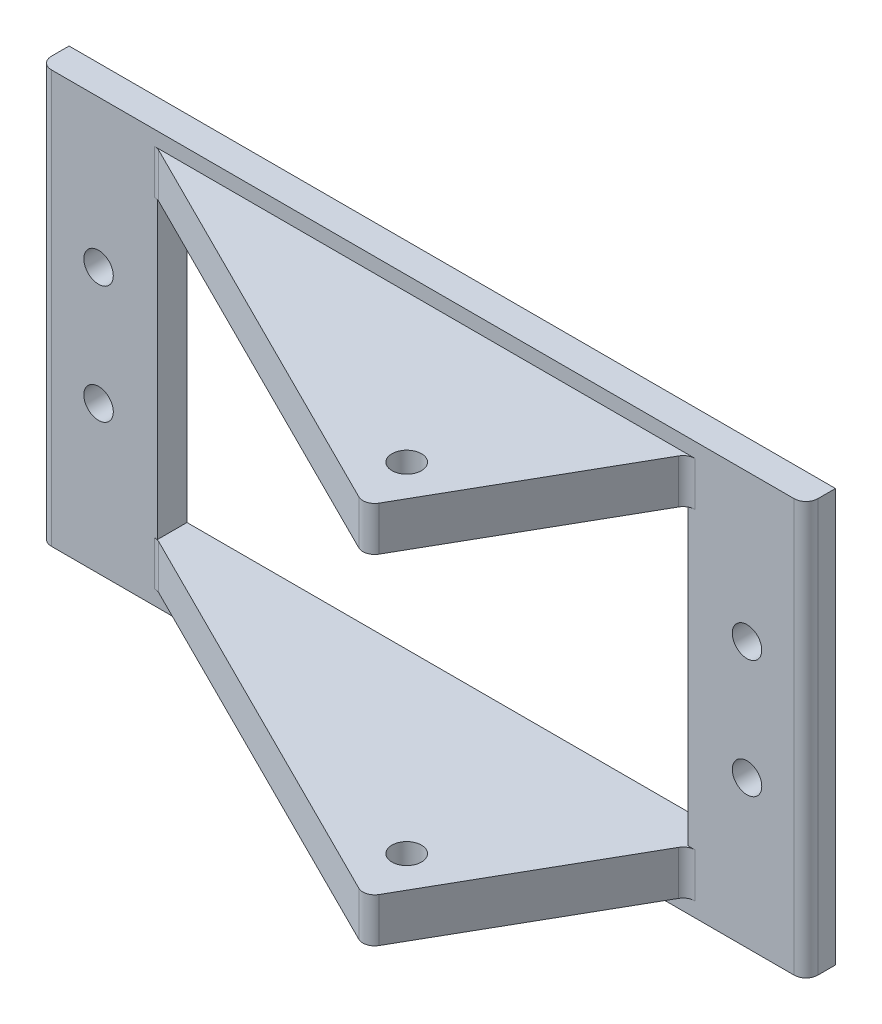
from build123d import *

# Parameters (mm, degrees)
SKETCH1_W           = 165.1
SKETCH1_H           = 88.9
BOSS_EXTRUDE1_DEPTH = 50.8
SKETCH2_R           = 3.175
SKETCH2_W           = 114.3
SKETCH2_H           = 63.5
CUT_EXTRUDE1_DEPTH  = 107.634633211
SKETCH4_W           = 165.1
SKETCH4_H           = 88.9
SKETCH4_W_2         = 114.3
SKETCH4_H_2         = 82.55
CUT_EXTRUDE2_DEPTH  = 44.45
SKETCH5_R           = 3.175
CUT_EXTRUDE4_DEPTH  = 130.398292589
FILLET2_R           = 2.54


with BuildPart() as part:
    # Sketch1 → Boss-Extrude1 (new body)
    with BuildSketch(Plane.XY):
        Rectangle(SKETCH1_W, SKETCH1_H)
    extrude(amount=BOSS_EXTRUDE1_DEPTH)

    # Sketch2 → Cut-Extrude1 (cut, through all)
    with BuildSketch(Plane.XY.offset(50.8)):
        with Locations((-69.85, 12.7)):
            Circle(SKETCH2_R)
        with Locations(Location((-69.85, -12.7, 0), (0, 0, 180))):
            Circle(SKETCH2_R)
        with Locations((69.85, -12.7)):
            Circle(SKETCH2_R)
        with Locations(Location((69.85, 12.7, 0), (0, 0, 180))):
            Circle(SKETCH2_R)
        Rectangle(SKETCH2_W, SKETCH2_H)
    extrude(amount=-CUT_EXTRUDE1_DEPTH, mode=Mode.SUBTRACT)

    # Sketch4 → Cut-Extrude2 (cut)
    with BuildSketch(Plane.XY.offset(50.8)):
        Rectangle(SKETCH4_W, SKETCH4_H)
        Rectangle(SKETCH4_W_2, SKETCH4_H_2, mode=Mode.SUBTRACT)
    extrude(amount=-CUT_EXTRUDE2_DEPTH, mode=Mode.SUBTRACT)

    # Sketch5 → Cut-Extrude4 (cut, through all)
    with BuildSketch(Plane.XZ.offset(41.275)):
        Polygon((-57.15, 6.35), (31.75, 50.8), (-57.15, 50.8), align=None)
        Polygon((31.75, 50.8), (57.15, 6.35), (57.15, 50.8), align=None)
        with Locations((28.286363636, 38.1)):
            Circle(SKETCH5_R)
    extrude(amount=-CUT_EXTRUDE4_DEPTH, mode=Mode.SUBTRACT)

    # Fillet2
    fillet2_edges = [part.edges().sort_by_distance(p)[0] for p in [
        (-57.15, 36.5125, 6.35),
        (-57.15, -36.5125, 6.35),
        (57.15, -36.5125, 6.35),
        (57.15, 36.5125, 6.35),
        (-82.55, 0, 6.35),
        (82.55, 0, 6.35),
        (31.75, -36.5125, 50.8),
        (31.75, 36.5125, 50.8),
    ]]
    fillet(fillet2_edges, radius=FILLET2_R)


solid = part.part
